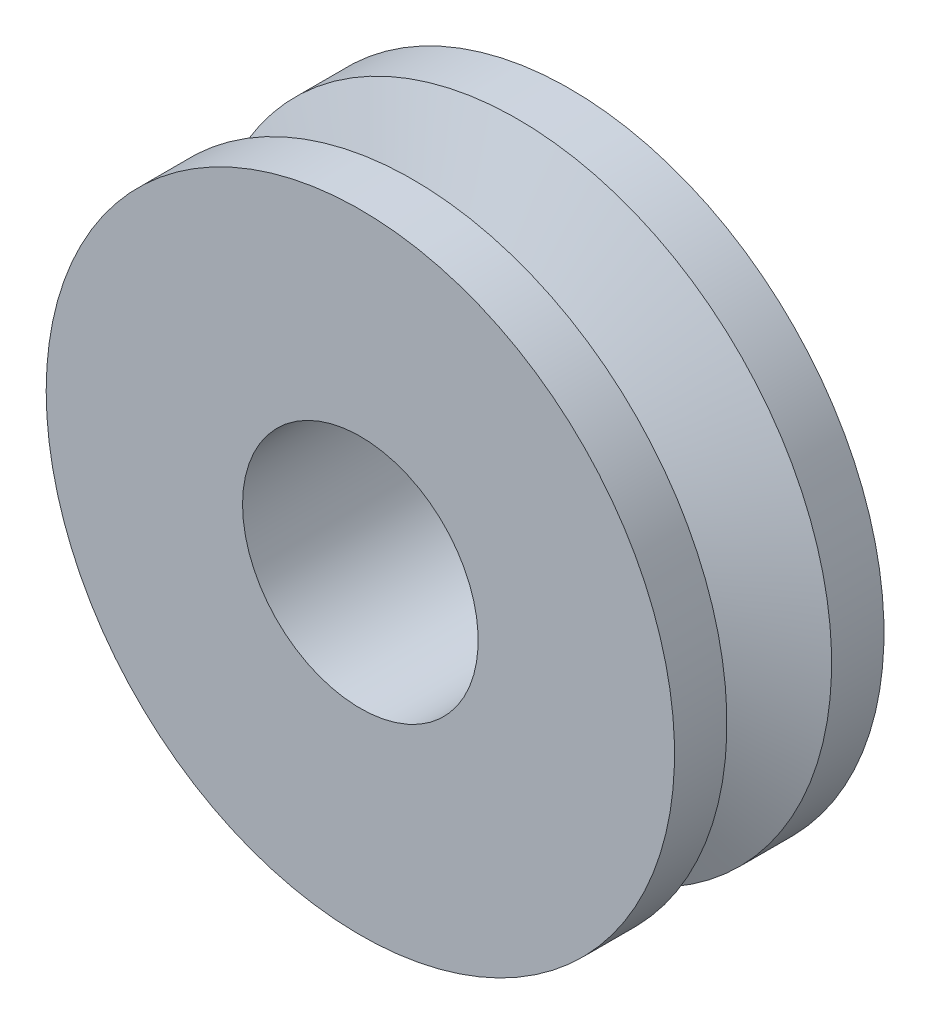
from build123d import *


with BuildPart() as part:
    # Sketch1 → Revolve1 (revolve)
    with BuildSketch(Plane(origin=(0, 0, 0), x_dir=(1, 0, 0), z_dir=(0, 1, 0)), mode=Mode.PRIVATE) as revolve1_sk:
        Polygon((5.625, 0), (5.625, -10), (15, -10), (15, -7.5), (8.964466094, -5), (15, -2.5), (15, 0), align=None)
    revolve(revolve1_sk.sketch.rotate(Axis((0, 0, 0), (0, 0, 1)), 180), axis=Axis((0, 0, 0), (0, 0, 1)))


solid = part.part
